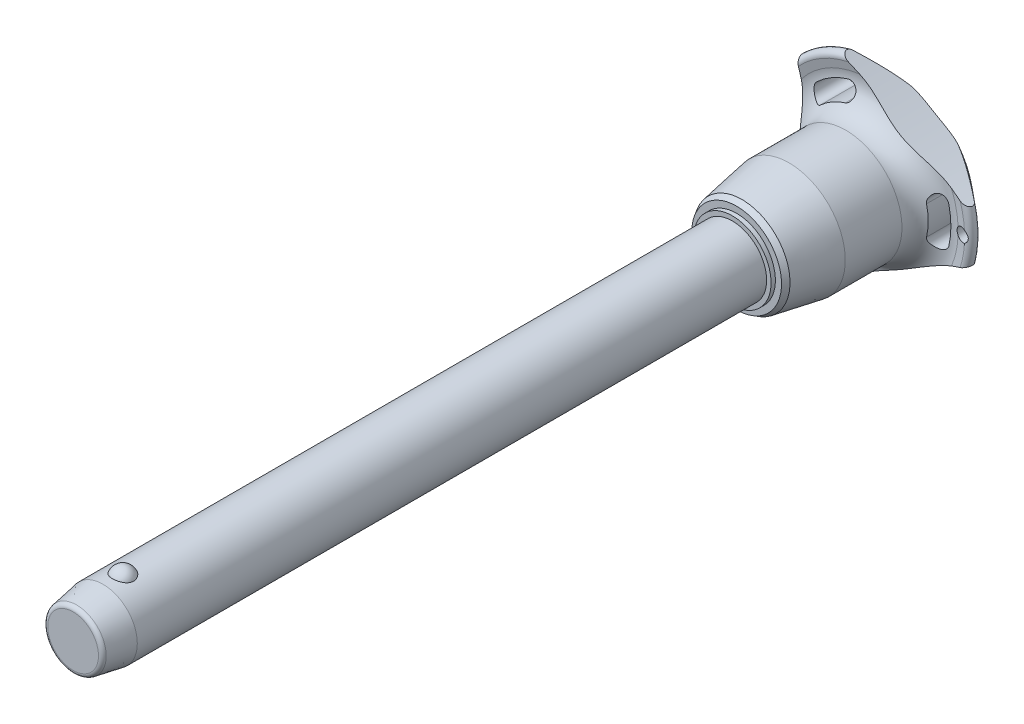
from build123d import *

# Parameters (mm, degrees)
SKETCH1_R           = 8
BOSS_EXTRUDE1_DEPTH = 140
SKETCH2_R           = 7
BOSS_EXTRUDE2_DEPTH = 39.7
BOSS_EXTRUDE3_START = 14
SKETCH1_2_R         = 8
BOSS_EXTRUDE3_DEPTH = 14
CHAMFER1_SIZE       = 7
CHAMFER1_SIZE2      = 1.234288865
FILLET1_R           = 1
SKETCH6_R           = 144.275
CUT_EXTRUDE1_DEPTH  = 183.827901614
CIRPATTERN1_COUNT   = 3
SKETCH7_R           = 1.5
CUT_EXTRUDE2_DEPTH  = 183.718098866


with BuildPart() as part:
    # Sketch1 → Boss-Extrude1 (new body)
    with BuildSketch(Plane.XY):
        Circle(SKETCH1_R)
    extrude(amount=-BOSS_EXTRUDE1_DEPTH)

    # Sketch2 → Boss-Extrude2 (add)
    with BuildSketch(Plane(origin=(0, 0, -140), x_dir=(-1, 0, 0), z_dir=(0, 0, -1))):
        Circle(SKETCH2_R)
    extrude(amount=BOSS_EXTRUDE2_DEPTH)

    # Sketch3 → Revolve1 (revolve)
    with BuildSketch(Plane(origin=(0, 0, 0), x_dir=(0, 0, -1), z_dir=(1, 0, 0))):
        with BuildLine():
            Line((-2.387467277, 9.5), (-2.387467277, 4.2))
            ThreePointArc((-2.387467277, 4.2), (0.262532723, 6.85), (-2.387467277, 9.5))
        make_face()
        with BuildLine():
            Line((-2.387467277, -4.2), (-2.387467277, -9.5))
            ThreePointArc((-2.387467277, -9.5), (0.262532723, -6.85), (-2.387467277, -4.2))
        make_face()
    revolve(axis=Axis((0, -4.2, 2.387467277), (0, 1, 0)))

    # Sketch1_2 → Boss-Extrude3 (add)
    with BuildSketch(Plane.XY.offset(BOSS_EXTRUDE3_START)):
        Circle(SKETCH1_2_R)
    extrude(amount=-BOSS_EXTRUDE3_DEPTH)

    # Chamfer1
    chamfer1_edges = [part.edges().sort_by_distance(p)[0] for p in [
        (-8, 0, 14),
    ]]
    chamfer1_side = [part.faces().sort_by_distance(p)[0] for p in [
        (-8, 0, -63),
    ]]
    chamfer(chamfer1_edges, length=CHAMFER1_SIZE, length2=CHAMFER1_SIZE2, reference=chamfer1_side[0])

    # Fillet1
    fillet1_edges = [part.edges().sort_by_distance(p)[0] for p in [
        (-6.765711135, 0, 14),
        (7, 0, -179.7),
    ]]
    fillet(fillet1_edges, radius=FILLET1_R)

    # Sketch4 → Revolve2 (revolve)
    with BuildSketch(Plane(origin=(0, 0, 0), x_dir=(0, 0, -1), z_dir=(1, 0, 0)), mode=Mode.PRIVATE) as revolve2_sk:
        Polygon((140, 0), (140, 9.044607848), (141, 9.044607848), (141, 10.490707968), (142.25235944, 11.213758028), (153.233333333, 13.15), (166.466666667, 13.15), (166.466666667, 0), align=None)
    revolve(revolve2_sk.sketch.rotate(Axis((0, 0, -166.466666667), (0, 0, 1)), 90), axis=Axis((0, 0, -166.466666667), (0, 0, 1)))

    # Sketch5 → Revolve3 (revolve)
    with BuildSketch(Plane(origin=(0, 0, 0), x_dir=(0, 0, -1), z_dir=(1, 0, 0)), mode=Mode.PRIVATE) as revolve3_sk:
        with BuildLine():
            Line((172.32877039, 20.428960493), (171.910912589, 22.344207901))
            ThreePointArc((171.910912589, 22.344207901), (172.554394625, 23.677136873), (174.002586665, 23.371345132))
            Line((174.002586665, 23.371345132), (179.141488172, 17.247040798))
            ThreePointArc((179.141488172, 17.247040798), (179.7, 15.584758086), (178.978803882, 13.986322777))
            ThreePointArc((178.978803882, 13.986322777), (174.617427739, 7.589034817), (173.083333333, 0))
            Line((173.083333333, 0), (166.466666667, 0))
            Line((166.466666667, 0), (166.466666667, 13.15))
            ThreePointArc((166.466666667, 13.15), (171.139661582, 15.38660811), (172.32877039, 20.428960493))
        make_face()
    revolve(revolve3_sk.sketch.rotate(Axis((0, 0, -173.083333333), (0, 0, 1)), 90), axis=Axis((0, 0, -173.083333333), (0, 0, 1)))

    # Sketch6 → Cut-Extrude1 (cut, through all)
    with BuildSketch(Plane.XY):
        with Locations((-159.975, 0)):
            Circle(SKETCH6_R)
        with BuildLine():
            ThreePointArc((18.131206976, -4.190753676), (18.60922037, 0), (18.131206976, 4.190753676))
            ThreePointArc((18.131206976, 4.190753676), (15.94840906, 5.553949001), (14.585213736, 3.371151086))
            ThreePointArc((14.585213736, 3.371151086), (14.969740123, 0), (14.585213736, -3.371151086))
            ThreePointArc((14.585213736, -3.371151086), (15.94840906, -5.553949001), (18.131206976, -4.190753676))
        make_face()
    cut_extrude1 = extrude(amount=-CUT_EXTRUDE1_DEPTH, mode=Mode.SUBTRACT)

    # CirPattern1: Cut-Extrude1 ×3 about axis
    cirpattern1_axis = Axis((0, 0, 0), (0, 0, 1))
    for i in range(1, CIRPATTERN1_COUNT):
        add(cut_extrude1.rotate(cirpattern1_axis, i * 360 / CIRPATTERN1_COUNT), mode=Mode.SUBTRACT)

    # Sketch7 → Cut-Extrude2 (cut, through all)
    with BuildSketch(Plane.XY):
        with Locations(Location((21.60922037, 0, 0), (0, 0, 297.620773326))):
            Circle(SKETCH7_R)
    extrude(amount=-CUT_EXTRUDE2_DEPTH, mode=Mode.SUBTRACT)


solid = part.part
